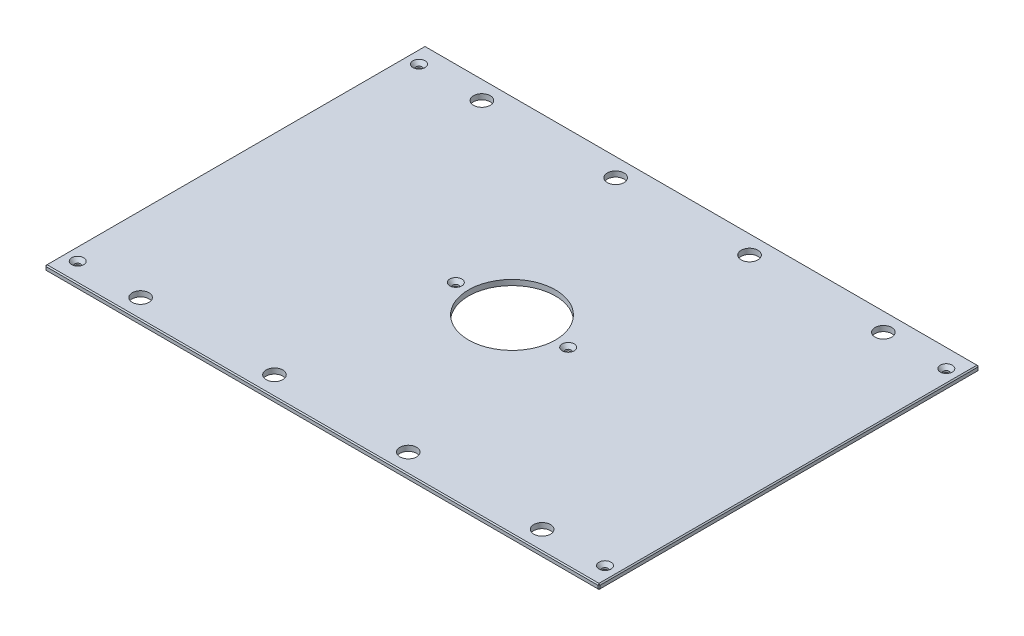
from build123d import *

# Parameters (mm, degrees)
SKETCH1_W                                     = 657.225
SKETCH1_H                                     = 450.85
BOSS_EXTRUDE1_DEPTH                           = 6.35
SKETCH13_R                                    = 51.562
CUT_EXTRUDE6_DEPTH                            = 399.551035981
F_25_32_0_78125_DIAMETER_HOLE1_D              = 19.84375
CHAMFER2_SIZE                                 = 1.27
CSK_FOR_1_4_FLAT_HEAD_MACHINE_SCREW1_AT_COUNT = 2
CSK_FOR_1_4_FLAT_HEAD_MACHINE_SCREW1_AT_PITCH = 404.80996
CSK_FOR_1_4_FLAT_HEAD_MACHINE_SCREW1_2_COUNT  = 2
CSK_FOR_1_4_FLAT_HEAD_MACHINE_SCREW1_2_PITCH  = 745.043676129
CSK_FOR_1_4_FLAT_HEAD_MACHINE_SCREW1_3_COUNT  = 2
CSK_FOR_1_4_FLAT_HEAD_MACHINE_SCREW1_3_PITCH  = 430.025140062
CSK_FOR_1_4_FLAT_HEAD_MACHINE_SCREW1_4_COUNT  = 2
CSK_FOR_1_4_FLAT_HEAD_MACHINE_SCREW1_4_PITCH  = 318.613448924
CSK_FOR_1_4_FLAT_HEAD_MACHINE_SCREW1_5_COUNT  = 2
CSK_FOR_1_4_FLAT_HEAD_MACHINE_SCREW1_5_PITCH  = 625.475
CSK_FOR_1_4_FLAT_HEAD_MACHINE_SCREW1_6_COUNT  = 2
CSK_FOR_1_4_FLAT_HEAD_MACHINE_SCREW1_6_PITCH  = 550.8625
CSK_FOR_1_4_FLAT_HEAD_MACHINE_SCREW1_7_COUNT  = 2
CSK_FOR_1_4_FLAT_HEAD_MACHINE_SCREW1_7_PITCH  = 683.608511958


with BuildPart() as part:
    # Sketch1 → Boss-Extrude1 (new body)
    with BuildSketch(Plane(origin=(0, 0, 0), x_dir=(1, 0, 0), z_dir=(0, 1, 0))):
        Rectangle(SKETCH1_W, SKETCH1_H)
    extrude(amount=BOSS_EXTRUDE1_DEPTH)

    # Sketch13 → Cut-Extrude6 (cut, through all)
    with BuildSketch(Plane(origin=(0, 6.35, 0), x_dir=(1, 0, 0), z_dir=(0, 1, 0))):
        with Locations(Location((0, 0, 0), (0, 0, 270))):
            Circle(SKETCH13_R)
    extrude(amount=-CUT_EXTRUDE6_DEPTH, mode=Mode.SUBTRACT)

    # 25_32 _0.78125_ Diameter Hole1 (through all)
    with Locations(Plane(origin=(0, 6.35, 0), x_dir=(1, 0, 0), z_dir=(0, 1, 0))):
        with Locations((238.125, 202.40498), (-238.125, 202.40498), (238.125, -202.40498), (-238.125, -202.40498), (-79.375, 202.40498), (79.375, 202.40498), (79.375, -202.40498), (-79.375, -202.40498)):
            Hole(F_25_32_0_78125_DIAMETER_HOLE1_D / 2)

    # Chamfer2
    chamfer2_edges = [part.edges().sort_by_distance(p)[0] for p in [
        (328.6125, 6.35, 0),
        (0, 6.35, -225.425),
        (-328.6125, 6.35, 0),
        (0, 0, -225.425),
        (328.6125, 0, 0),
        (0, 0, 225.425),
        (-328.6125, 0, 0),
        (0, 6.35, 225.425),
        (-328.6125, 3.175, -225.425),
        (328.6125, 3.175, -225.425),
        (328.6125, 3.175, 225.425),
        (-328.6125, 3.175, 225.425),
    ]]
    chamfer(chamfer2_edges, length=CHAMFER2_SIZE)

    # Sketch24 → CSK for 1_4 Flat Head Machine Screw1 (revolve, cut)
    with BuildSketch(Plane(origin=(312.7375, 6.35, -202.40498), x_dir=(0, 0, 1), z_dir=(1, 0, 0))):
        Polygon((0, 0), (0, 6.35), (3.3782, 6.35), (3.3782, 4.324464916), (7.1374, 0), align=None)
    csk_for_1_4_flat_head_machine_screw1 = revolve(axis=Axis((312.7375, 12.7, -202.40498), (0, -1, 0)), mode=Mode.SUBTRACT)

    # CSK for 1_4 Flat Head Machine Screw1 at: CSK for 1_4 Flat Head Machine Screw1 ×2
    with Locations(*[(0, 0, i * CSK_FOR_1_4_FLAT_HEAD_MACHINE_SCREW1_AT_PITCH) for i in range(1, CSK_FOR_1_4_FLAT_HEAD_MACHINE_SCREW1_AT_COUNT)]):
        add(csk_for_1_4_flat_head_machine_screw1, mode=Mode.SUBTRACT)

    # CSK for 1_4 Flat Head Machine Screw1 2: CSK for 1_4 Flat Head Machine Screw1 ×2
    with Locations(*[Vector(-0.8395145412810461, 0, 0.5433372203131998) * (i * CSK_FOR_1_4_FLAT_HEAD_MACHINE_SCREW1_2_PITCH) for i in range(1, CSK_FOR_1_4_FLAT_HEAD_MACHINE_SCREW1_2_COUNT)]):
        add(csk_for_1_4_flat_head_machine_screw1, mode=Mode.SUBTRACT)

    # CSK for 1_4 Flat Head Machine Screw1 3: CSK for 1_4 Flat Head Machine Screw1 ×2
    with Locations(*[Vector(-0.8823030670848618, 0, 0.470681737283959) * (i * CSK_FOR_1_4_FLAT_HEAD_MACHINE_SCREW1_3_PITCH) for i in range(1, CSK_FOR_1_4_FLAT_HEAD_MACHINE_SCREW1_3_COUNT)]):
        add(csk_for_1_4_flat_head_machine_screw1, mode=Mode.SUBTRACT)

    # CSK for 1_4 Flat Head Machine Screw1 4: CSK for 1_4 Flat Head Machine Screw1 ×2
    with Locations(*[Vector(-0.7722916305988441, 0, 0.6352681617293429) * (i * CSK_FOR_1_4_FLAT_HEAD_MACHINE_SCREW1_4_PITCH) for i in range(1, CSK_FOR_1_4_FLAT_HEAD_MACHINE_SCREW1_4_COUNT)]):
        add(csk_for_1_4_flat_head_machine_screw1, mode=Mode.SUBTRACT)

    # CSK for 1_4 Flat Head Machine Screw1 5: CSK for 1_4 Flat Head Machine Screw1 ×2
    with Locations(*[(-i * CSK_FOR_1_4_FLAT_HEAD_MACHINE_SCREW1_5_PITCH, 0, 0) for i in range(1, CSK_FOR_1_4_FLAT_HEAD_MACHINE_SCREW1_5_COUNT)]):
        add(csk_for_1_4_flat_head_machine_screw1, mode=Mode.SUBTRACT)

    # CSK for 1_4 Flat Head Machine Screw1 6: CSK for 1_4 Flat Head Machine Screw1 ×2
    with Locations(*[(-i * CSK_FOR_1_4_FLAT_HEAD_MACHINE_SCREW1_6_PITCH, 0, 0) for i in range(1, CSK_FOR_1_4_FLAT_HEAD_MACHINE_SCREW1_6_COUNT)]):
        add(csk_for_1_4_flat_head_machine_screw1, mode=Mode.SUBTRACT)

    # CSK for 1_4 Flat Head Machine Screw1 7: CSK for 1_4 Flat Head Machine Screw1 ×2
    with Locations(*[Vector(-0.8058157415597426, 0, 0.5921663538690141) * (i * CSK_FOR_1_4_FLAT_HEAD_MACHINE_SCREW1_7_PITCH) for i in range(1, CSK_FOR_1_4_FLAT_HEAD_MACHINE_SCREW1_7_COUNT)]):
        add(csk_for_1_4_flat_head_machine_screw1, mode=Mode.SUBTRACT)


solid = part.part
